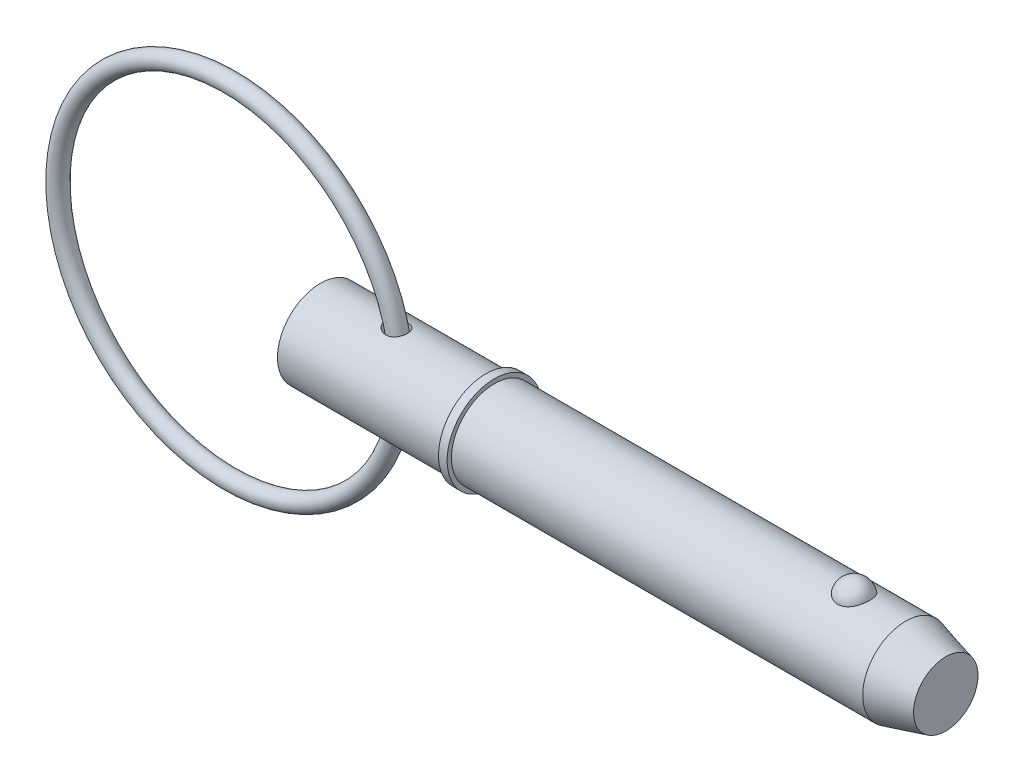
ISO-10303-21;
HEADER;
FILE_DESCRIPTION(('STEP AP214'),'2;1');
FILE_NAME('part.step','',(''),(''),'','','');
FILE_SCHEMA(('AUTOMOTIVE_DESIGN { 1 0 10303 214 1 1 1 1 }'));
ENDSEC;
DATA;
#1=APPLICATION_CONTEXT('core data for automotive mechanical design processes');
#2=APPLICATION_PROTOCOL_DEFINITION('international standard','automotive_design',2000,#1);
#3=PRODUCT_CONTEXT('',#1,'mechanical');
#4=PRODUCT('Part','Part','',(#3));
#5=PRODUCT_RELATED_PRODUCT_CATEGORY('part','',(#4));
#6=PRODUCT_DEFINITION_FORMATION('','',#4);
#7=PRODUCT_DEFINITION_CONTEXT('part definition',#1,'design');
#8=PRODUCT_DEFINITION('design','',#6,#7);
#9=PRODUCT_DEFINITION_SHAPE('','',#8);
#10=(LENGTH_UNIT() NAMED_UNIT(*) SI_UNIT(.MILLI.,.METRE.));
#11=(NAMED_UNIT(*) PLANE_ANGLE_UNIT() SI_UNIT($,.RADIAN.));
#12=(NAMED_UNIT(*) SI_UNIT($,.STERADIAN.) SOLID_ANGLE_UNIT());
#13=UNCERTAINTY_MEASURE_WITH_UNIT(LENGTH_MEASURE(1.E-05),#10,'distance_accuracy_value','');
#14=(GEOMETRIC_REPRESENTATION_CONTEXT(3) GLOBAL_UNCERTAINTY_ASSIGNED_CONTEXT((#13)) GLOBAL_UNIT_ASSIGNED_CONTEXT((#10,
#11,#12)) REPRESENTATION_CONTEXT('',''));
#15=CARTESIAN_POINT('',(0.,0.,0.));
#16=DIRECTION('',(0.,0.,1.));
#17=DIRECTION('',(1.,0.,0.));
#18=AXIS2_PLACEMENT_3D('',#15,#16,#17);
#19=CARTESIAN_POINT('',(-13.3798047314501,0.,0.));
#20=DIRECTION('',(0.,0.,1.));
#21=DIRECTION('',(1.,0.,0.));
#22=AXIS2_PLACEMENT_3D('',#19,#20,#21);
#23=TOROIDAL_SURFACE('',#22,25.4,1.27);
#24=CARTESIAN_POINT('',(13.2901952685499,0.,0.));
#25=VERTEX_POINT('',#24);
#26=VERTEX_LOOP('',#25);
#27=FACE_BOUND('',#26,.T.);
#28=ADVANCED_FACE('P0_F12',(#27),#23,.T.);
#29=CLOSED_SHELL('',(#28));
#30=MANIFOLD_SOLID_BREP('P0_B1',#29);
#31=CARTESIAN_POINT('',(0.,0.,0.));
#32=DIRECTION('',(1.,0.,0.));
#33=DIRECTION('',(0.,0.,-1.));
#34=AXIS2_PLACEMENT_3D('',#31,#32,#33);
#35=CYLINDRICAL_SURFACE('',#34,6.35);
#36=CARTESIAN_POINT('',(9.67500140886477,6.32698634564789,-0.540133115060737));
#37=CARTESIAN_POINT('',(9.70878953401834,6.3197498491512,-0.624879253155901));
#38=CARTESIAN_POINT('',(9.75028044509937,6.31105328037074,-0.706504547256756));
#39=CARTESIAN_POINT('',(9.84659255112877,6.29180070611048,-0.861319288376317));
#40=CARTESIAN_POINT('',(9.90144039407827,6.28124099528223,-0.934491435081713));
#41=CARTESIAN_POINT('',(10.021999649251,6.25949497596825,-1.0704877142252));
#42=CARTESIAN_POINT('',(10.0876589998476,6.2483118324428,-1.13335868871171));
#43=CARTESIAN_POINT('',(10.2280180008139,6.22641783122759,-1.24805262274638));
#44=CARTESIAN_POINT('',(10.3027159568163,6.21570688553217,-1.29987764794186));
#45=CARTESIAN_POINT('',(10.4650889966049,6.19509606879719,-1.39492899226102));
#46=CARTESIAN_POINT('',(10.5533142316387,6.1853135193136,-1.4372443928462));
#47=CARTESIAN_POINT('',(10.7357818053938,6.16871128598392,-1.50691441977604));
#48=CARTESIAN_POINT('',(10.8300253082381,6.16189217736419,-1.53426614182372));
#49=CARTESIAN_POINT('',(11.0227953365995,6.15211299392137,-1.57302798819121));
#50=CARTESIAN_POINT('',(11.1213511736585,6.14918579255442,-1.58430237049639));
#51=CARTESIAN_POINT('',(11.3189518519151,6.1478413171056,-1.58951619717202));
#52=CARTESIAN_POINT('',(11.417996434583,6.14942187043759,-1.58346399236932));
#53=CARTESIAN_POINT('',(11.6070859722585,6.15678569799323,-1.55457003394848));
#54=CARTESIAN_POINT('',(11.6973059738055,6.16229943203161,-1.53280404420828));
#55=CARTESIAN_POINT('',(11.8723373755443,6.17663058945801,-1.4739892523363));
#56=CARTESIAN_POINT('',(11.9571502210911,6.185447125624,-1.43694455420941));
#57=CARTESIAN_POINT('',(12.1146737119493,6.20482821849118,-1.35072170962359));
#58=CARTESIAN_POINT('',(12.1877743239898,6.21528554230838,-1.30222952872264));
#59=CARTESIAN_POINT('',(12.3246187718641,6.23705116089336,-1.19362916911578));
#60=CARTESIAN_POINT('',(12.3883628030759,6.24835943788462,-1.1335212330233));
#61=CARTESIAN_POINT('',(12.5046662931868,6.27053957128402,-1.00357204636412));
#62=CARTESIAN_POINT('',(12.5572571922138,6.28141258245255,-0.933759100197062));
#63=CARTESIAN_POINT('',(12.6502125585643,6.30157953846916,-0.786214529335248));
#64=CARTESIAN_POINT('',(12.6905764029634,6.31087340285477,-0.708482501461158));
#65=CARTESIAN_POINT('',(12.7585531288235,6.32699259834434,-0.546246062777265));
#66=CARTESIAN_POINT('',(12.7860022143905,6.33378599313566,-0.46166981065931));
#67=CARTESIAN_POINT('',(12.8267605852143,6.34401050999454,-0.288980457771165));
#68=CARTESIAN_POINT('',(12.8400695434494,6.34744155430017,-0.200867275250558));
#69=CARTESIAN_POINT('',(12.8522644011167,6.35058177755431,-0.023194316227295));
#70=CARTESIAN_POINT('',(12.8510870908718,6.35027464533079,0.0663700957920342));
#71=CARTESIAN_POINT('',(12.8341831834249,6.34593169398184,0.244024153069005));
#72=CARTESIAN_POINT('',(12.8184563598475,6.341895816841,0.332113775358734));
#73=CARTESIAN_POINT('',(12.7728208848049,6.33052992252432,0.504322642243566));
#74=CARTESIAN_POINT('',(12.7429114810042,6.32319973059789,0.58844167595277));
#75=CARTESIAN_POINT('',(12.6696162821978,6.30604116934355,0.750316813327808));
#76=CARTESIAN_POINT('',(12.6262302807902,6.29621276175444,0.828072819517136));
#77=CARTESIAN_POINT('',(12.5270856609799,6.27515240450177,0.974918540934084));
#78=CARTESIAN_POINT('',(12.4713403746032,6.26392197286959,1.04401746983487));
#79=CARTESIAN_POINT('',(12.3488662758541,6.24131002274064,1.1716478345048));
#80=CARTESIAN_POINT('',(12.2821384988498,6.22992851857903,1.23018026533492));
#81=CARTESIAN_POINT('',(12.1401870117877,6.20841765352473,1.33449214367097));
#82=CARTESIAN_POINT('',(12.0650507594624,6.19827734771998,1.38038832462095));
#83=CARTESIAN_POINT('',(11.9079044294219,6.18026478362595,1.45892404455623));
#84=CARTESIAN_POINT('',(11.8258951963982,6.17239224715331,1.49156520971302));
#85=CARTESIAN_POINT('',(11.6581736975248,6.15982613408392,1.54263810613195));
#86=CARTESIAN_POINT('',(11.572502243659,6.15510409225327,1.56119728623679));
#87=CARTESIAN_POINT('',(11.3991899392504,6.14916283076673,1.58443707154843));
#88=CARTESIAN_POINT('',(11.3115488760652,6.14794399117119,1.58911617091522));
#89=CARTESIAN_POINT('',(11.1345547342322,6.14904466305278,1.58485137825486));
#90=CARTESIAN_POINT('',(11.0452104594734,6.15144894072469,1.5755811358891));
#91=CARTESIAN_POINT('',(10.8691479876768,6.15957601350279,1.54349959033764));
#92=CARTESIAN_POINT('',(10.782430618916,6.16529984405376,1.52068406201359));
#93=CARTESIAN_POINT('',(10.6082848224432,6.17983892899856,1.4605156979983));
#94=CARTESIAN_POINT('',(10.5211557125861,6.1888262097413,1.42233764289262));
#95=CARTESIAN_POINT('',(10.3542377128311,6.20874782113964,1.33268652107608));
#96=CARTESIAN_POINT('',(10.2744521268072,6.21968302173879,1.28120750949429));
#97=CARTESIAN_POINT('',(10.120854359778,6.24282707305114,1.16334748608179));
#98=CARTESIAN_POINT('',(10.0474902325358,6.25507146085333,1.09638652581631));
#99=CARTESIAN_POINT('',(9.9136869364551,6.27890019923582,0.950453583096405));
#100=CARTESIAN_POINT('',(9.85324511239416,6.29048468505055,0.871484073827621));
#101=CARTESIAN_POINT('',(9.75037543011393,6.31102161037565,0.707140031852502));
#102=CARTESIAN_POINT('',(9.70726585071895,6.32006820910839,0.622206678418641));
#103=CARTESIAN_POINT('',(9.63775895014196,6.33497125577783,0.445490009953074));
#104=CARTESIAN_POINT('',(9.61134627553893,6.34083063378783,0.35371307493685));
#105=CARTESIAN_POINT('',(9.57891955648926,6.34807071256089,0.177220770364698));
#106=CARTESIAN_POINT('',(9.57093524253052,6.3498832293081,0.0928817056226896));
#107=CARTESIAN_POINT('',(9.56994851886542,6.35010532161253,-0.0758268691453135));
#108=CARTESIAN_POINT('',(9.57692695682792,6.34851924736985,-0.160196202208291));
#109=CARTESIAN_POINT('',(9.59985709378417,6.34339435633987,-0.294043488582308));
#110=CARTESIAN_POINT('',(9.61128951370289,6.34084912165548,-0.344385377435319));
#111=CARTESIAN_POINT('',(9.63933183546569,6.33468615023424,-0.443526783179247));
#112=CARTESIAN_POINT('',(9.65594100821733,6.33106856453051,-0.492326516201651));
#113=CARTESIAN_POINT('',(9.67500140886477,6.32698634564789,-0.540133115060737));
#114=B_SPLINE_CURVE_WITH_KNOTS('',3,(#36,#37,#38,#39,#40,#41,#42,#43,#44,#45,#46,#47,#48,#49,
#50,#51,#52,#53,#54,#55,#56,#57,#58,#59,#60,#61,#62,#63,#64,#65,#66,#67,#68,#69,#70,#71,#72,#73,
#74,#75,#76,#77,#78,#79,#80,#81,#82,#83,#84,#85,#86,#87,#88,#89,#90,#91,#92,#93,#94,#95,#96,#97,
#98,#99,#100,#101,#102,#103,#104,#105,#106,#107,#108,#109,#110,#111,#112,#113),.UNSPECIFIED.,
.T.,.F.,(4,2,2,2,2,2,2,2,2,2,2,2,2,2,2,2,2,2,2,2,2,2,2,2,2,2,2,2,2,2,2,2,2,2,2,2,2,2,4),(0.,
0.274348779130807,0.549249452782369,0.822863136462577,1.09642560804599,1.39007706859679,
1.68378550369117,1.97995934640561,2.27599046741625,2.55347281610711,2.83088067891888,
3.09465189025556,3.35841759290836,3.62142956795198,3.88445494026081,4.1507318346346,
4.4170148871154,4.68446025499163,4.95190978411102,5.21937350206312,5.48684131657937,
5.75402200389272,6.02117751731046,6.28577524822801,6.55034050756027,6.81248178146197,
7.0746514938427,7.34305086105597,7.61153399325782,7.89692981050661,8.18245340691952,
8.48120635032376,8.77989784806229,9.06530254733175,9.35044442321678,9.60331609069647,
9.85586427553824,10.010650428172,10.1654147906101),.UNSPECIFIED.);
#115=CARTESIAN_POINT('',(9.67500140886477,6.32698634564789,-0.540133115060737));
#116=VERTEX_POINT('',#115);
#117=EDGE_CURVE('P1_E42',#116,#116,#114,.T.);
#118=ORIENTED_EDGE('',*,*,#117,.T.);
#119=EDGE_LOOP('',(#118));
#120=FACE_BOUND('',#119,.T.);
#121=CARTESIAN_POINT('',(0.,0.,0.));
#122=DIRECTION('',(1.,0.,0.));
#123=DIRECTION('',(0.,0.,-1.));
#124=AXIS2_PLACEMENT_3D('',#121,#122,#123);
#125=CIRCLE('',#124,6.35);
#126=CARTESIAN_POINT('',(0.,0.,-6.35));
#127=VERTEX_POINT('',#126);
#128=EDGE_CURVE('P1_E9',#127,#127,#125,.T.);
#129=ORIENTED_EDGE('',*,*,#128,.T.);
#130=EDGE_LOOP('',(#129));
#131=FACE_BOUND('',#130,.T.);
#132=CARTESIAN_POINT('',(24.43,0.,0.));
#133=DIRECTION('',(1.,0.,0.));
#134=DIRECTION('',(0.,0.,-1.));
#135=AXIS2_PLACEMENT_3D('',#132,#133,#134);
#136=CIRCLE('',#135,6.35);
#137=CARTESIAN_POINT('',(24.43,0.,-6.35));
#138=VERTEX_POINT('',#137);
#139=EDGE_CURVE('P1_E25',#138,#138,#136,.T.);
#140=ORIENTED_EDGE('',*,*,#139,.F.);
#141=EDGE_LOOP('',(#140));
#142=FACE_BOUND('',#141,.T.);
#143=CARTESIAN_POINT('',(9.67500140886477,-6.32698634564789,-0.540133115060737));
#144=CARTESIAN_POINT('',(9.64544894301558,-6.33331515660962,-0.466002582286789));
#145=CARTESIAN_POINT('',(9.62177180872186,-6.33852974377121,-0.389437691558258));
#146=CARTESIAN_POINT('',(9.58727043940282,-6.34619174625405,-0.233330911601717));
#147=CARTESIAN_POINT('',(9.57644043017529,-6.34864040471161,-0.153790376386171));
#148=CARTESIAN_POINT('',(9.56819517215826,-6.3505010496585,0.00612071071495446));
#149=CARTESIAN_POINT('',(9.57079639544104,-6.34990930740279,0.0864921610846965));
#150=CARTESIAN_POINT('',(9.58930797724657,-6.3457478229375,0.245607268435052));
#151=CARTESIAN_POINT('',(9.60522046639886,-6.34217760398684,0.324350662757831));
#152=CARTESIAN_POINT('',(9.64931570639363,-6.3324977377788,0.47727605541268));
#153=CARTESIAN_POINT('',(9.67737525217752,-6.32641361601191,0.551495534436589));
#154=CARTESIAN_POINT('',(9.74451510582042,-6.31231128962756,0.694551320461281));
#155=CARTESIAN_POINT('',(9.78359827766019,-6.30429258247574,0.763386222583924));
#156=CARTESIAN_POINT('',(9.87474700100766,-6.28638332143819,0.899414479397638));
#157=CARTESIAN_POINT('',(9.92757481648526,-6.27639669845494,0.966083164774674));
#158=CARTESIAN_POINT('',(10.042675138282,-6.25596164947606,1.09061181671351));
#159=CARTESIAN_POINT('',(10.1049521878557,-6.24551300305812,1.14846751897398));
#160=CARTESIAN_POINT('',(10.2445505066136,-6.22397505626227,1.26024641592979));
#161=CARTESIAN_POINT('',(10.3227711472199,-6.2129394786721,1.31305951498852));
#162=CARTESIAN_POINT('',(10.4867924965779,-6.19263757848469,1.40570084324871));
#163=CARTESIAN_POINT('',(10.5725962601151,-6.18337197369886,1.44552380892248));
#164=CARTESIAN_POINT('',(10.7543302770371,-6.16725983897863,1.51283687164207));
#165=CARTESIAN_POINT('',(10.8505554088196,-6.16056505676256,1.53957358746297));
#166=CARTESIAN_POINT('',(11.0463546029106,-6.15127671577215,1.57628137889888));
#167=CARTESIAN_POINT('',(11.1459276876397,-6.14868197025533,1.58625730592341));
#168=CARTESIAN_POINT('',(11.3414257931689,-6.14810798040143,1.58848000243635));
#169=CARTESIAN_POINT('',(11.4373417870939,-6.14995283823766,1.58140242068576));
#170=CARTESIAN_POINT('',(11.6262783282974,-6.1577972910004,1.55057566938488));
#171=CARTESIAN_POINT('',(11.719300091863,-6.16379511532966,1.52683360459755));
#172=CARTESIAN_POINT('',(11.8934223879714,-6.17873566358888,1.46514575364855));
#173=CARTESIAN_POINT('',(11.9749048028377,-6.18746207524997,1.42822144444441));
#174=CARTESIAN_POINT('',(12.1301362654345,-6.20693584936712,1.3410564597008));
#175=CARTESIAN_POINT('',(12.2038861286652,-6.21768299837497,1.29081719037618));
#176=CARTESIAN_POINT('',(12.3399792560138,-6.23970077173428,1.17972764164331));
#177=CARTESIAN_POINT('',(12.4025430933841,-6.25095401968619,1.11914355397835));
#178=CARTESIAN_POINT('',(12.5166805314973,-6.27296916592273,0.988307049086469));
#179=CARTESIAN_POINT('',(12.568253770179,-6.28373104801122,0.918054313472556));
#180=CARTESIAN_POINT('',(12.6596230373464,-6.3037060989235,0.769081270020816));
#181=CARTESIAN_POINT('',(12.6992956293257,-6.31290263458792,0.690283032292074));
#182=CARTESIAN_POINT('',(12.7652258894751,-6.32862394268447,0.527011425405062));
#183=CARTESIAN_POINT('',(12.7914829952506,-6.33514860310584,0.442537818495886));
#184=CARTESIAN_POINT('',(12.8301436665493,-6.34487485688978,0.269505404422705));
#185=CARTESIAN_POINT('',(12.8424230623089,-6.34804664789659,0.180917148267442));
#186=CARTESIAN_POINT('',(12.8524214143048,-6.35062347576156,0.00286829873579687));
#187=CARTESIAN_POINT('',(12.8501402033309,-6.35002846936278,-0.0865923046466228));
#188=CARTESIAN_POINT('',(12.8310619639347,-6.34513332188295,-0.263931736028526));
#189=CARTESIAN_POINT('',(12.8142517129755,-6.34082980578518,-0.35180904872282));
#190=CARTESIAN_POINT('',(12.7664911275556,-6.32897674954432,-0.523406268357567));
#191=CARTESIAN_POINT('',(12.7355404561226,-6.3214271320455,-0.607126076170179));
#192=CARTESIAN_POINT('',(12.6602298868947,-6.30390232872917,-0.768030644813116));
#193=CARTESIAN_POINT('',(12.6158695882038,-6.29392707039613,-0.84521521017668));
#194=CARTESIAN_POINT('',(12.5148171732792,-6.2726521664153,-0.990836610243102));
#195=CARTESIAN_POINT('',(12.4581254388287,-6.26135256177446,-1.05927371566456));
#196=CARTESIAN_POINT('',(12.33416419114,-6.2387572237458,-1.18510935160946));
#197=CARTESIAN_POINT('',(12.2669484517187,-6.22746174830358,-1.24256086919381));
#198=CARTESIAN_POINT('',(12.1235592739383,-6.20610255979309,-1.34519464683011));
#199=CARTESIAN_POINT('',(12.0473871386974,-6.19603866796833,-1.39037868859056));
#200=CARTESIAN_POINT('',(11.8892714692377,-6.17839642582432,-1.46678006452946));
#201=CARTESIAN_POINT('',(11.8074126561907,-6.17078838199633,-1.49816605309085));
#202=CARTESIAN_POINT('',(11.6394563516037,-6.15869606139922,-1.54712759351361));
#203=CARTESIAN_POINT('',(11.5533589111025,-6.15421174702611,-1.56470331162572));
#204=CARTESIAN_POINT('',(11.3789660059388,-6.14876652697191,-1.58596734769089));
#205=CARTESIAN_POINT('',(11.2906621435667,-6.1478222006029,-1.58959032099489));
#206=CARTESIAN_POINT('',(11.1146029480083,-6.149490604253,-1.58312110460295));
#207=CARTESIAN_POINT('',(11.0268477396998,-6.1521041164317,-1.57302589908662));
#208=CARTESIAN_POINT('',(10.8498668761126,-6.16071031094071,-1.53898332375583));
#209=CARTESIAN_POINT('',(10.7607726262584,-6.16685908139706,-1.51439468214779));
#210=CARTESIAN_POINT('',(10.5876521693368,-6.18189031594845,-1.45181305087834));
#211=CARTESIAN_POINT('',(10.5036282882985,-6.19077402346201,-1.41381396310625));
#212=CARTESIAN_POINT('',(10.3374228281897,-6.2109378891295,-1.32252480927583));
#213=CARTESIAN_POINT('',(10.255708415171,-6.2223355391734,-1.26840756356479));
#214=CARTESIAN_POINT('',(10.1025645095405,-6.24580740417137,-1.14725208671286));
#215=CARTESIAN_POINT('',(10.0311354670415,-6.25788164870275,-1.08021329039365));
#216=CARTESIAN_POINT('',(9.90472699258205,-6.2806176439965,-0.938710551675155));
#217=CARTESIAN_POINT('',(9.84904456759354,-6.29132066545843,-0.864883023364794));
#218=CARTESIAN_POINT('',(9.75129345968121,-6.31084098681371,-0.708496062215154));
#219=CARTESIAN_POINT('',(9.70921094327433,-6.31966019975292,-0.625945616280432));
#220=CARTESIAN_POINT('',(9.67500140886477,-6.32698634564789,-0.540133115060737));
#221=B_SPLINE_CURVE_WITH_KNOTS('',3,(#143,#144,#145,#146,#147,#148,#149,#150,#151,#152,#153,
#154,#155,#156,#157,#158,#159,#160,#161,#162,#163,#164,#165,#166,#167,#168,#169,#170,#171,#172,
#173,#174,#175,#176,#177,#178,#179,#180,#181,#182,#183,#184,#185,#186,#187,#188,#189,#190,#191,
#192,#193,#194,#195,#196,#197,#198,#199,#200,#201,#202,#203,#204,#205,#206,#207,#208,#209,#210,
#211,#212,#213,#214,#215,#216,#217,#218,#219,#220),.UNSPECIFIED.,.T.,.F.,(4,2,2,2,2,2,2,2,2,2,2,
2,2,2,2,2,2,2,2,2,2,2,2,2,2,2,2,2,2,2,2,2,2,2,2,2,2,2,4),(0.,0.239871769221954,
0.479635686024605,0.719693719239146,0.959790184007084,1.19750645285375,1.43528453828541,
1.69117930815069,1.94719750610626,2.23102979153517,2.51497694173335,2.81376497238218,
3.11246650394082,3.39952951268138,3.68647020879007,3.95479420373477,4.22308987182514,
4.48530700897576,4.74753278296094,5.01239119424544,5.27726070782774,5.54446524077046,
5.81167284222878,6.07912387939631,6.34658129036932,6.61404669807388,6.88150382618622,
7.14763644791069,7.41373039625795,7.67647472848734,7.93921589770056,8.20318607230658,
8.46721428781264,8.74390821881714,9.02072813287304,9.31537622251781,9.61003720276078,
9.88799314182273,10.1656654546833),.UNSPECIFIED.);
#222=CARTESIAN_POINT('',(9.67500140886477,-6.32698634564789,-0.540133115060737));
#223=VERTEX_POINT('',#222);
#224=EDGE_CURVE('P1_E17',#223,#223,#221,.T.);
#225=ORIENTED_EDGE('',*,*,#224,.T.);
#226=EDGE_LOOP('',(#225));
#227=FACE_BOUND('',#226,.T.);
#228=ADVANCED_FACE('P1_F13',(#120,#131,#142,#227),#35,.T.);
#229=CARTESIAN_POINT('',(0.,0.,0.));
#230=DIRECTION('',(1.,0.,0.));
#231=DIRECTION('',(0.,0.,-1.));
#232=AXIS2_PLACEMENT_3D('',#229,#230,#231);
#233=CYLINDRICAL_SURFACE('',#232,6.35);
#234=CARTESIAN_POINT('',(86.4553693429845,0.,0.));
#235=DIRECTION('',(1.,0.,0.));
#236=DIRECTION('',(0.,0.,-1.));
#237=AXIS2_PLACEMENT_3D('',#234,#235,#236);
#238=CIRCLE('',#237,6.35);
#239=CARTESIAN_POINT('',(86.4553693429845,0.,-6.35));
#240=VERTEX_POINT('',#239);
#241=EDGE_CURVE('P1_E99',#240,#240,#238,.T.);
#242=ORIENTED_EDGE('',*,*,#241,.F.);
#243=EDGE_LOOP('',(#242));
#244=FACE_BOUND('',#243,.T.);
#245=CARTESIAN_POINT('',(25.7,0.,0.));
#246=DIRECTION('',(1.,0.,0.));
#247=DIRECTION('',(0.,0.,-1.));
#248=AXIS2_PLACEMENT_3D('',#245,#246,#247);
#249=CIRCLE('',#248,6.35);
#250=CARTESIAN_POINT('',(25.7,0.,-6.35));
#251=VERTEX_POINT('',#250);
#252=EDGE_CURVE('P1_E96',#251,#251,#249,.T.);
#253=ORIENTED_EDGE('',*,*,#252,.T.);
#254=EDGE_LOOP('',(#253));
#255=FACE_BOUND('',#254,.T.);
#256=CARTESIAN_POINT('',(78.8300214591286,5.87502187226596,2.40969251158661));
#257=CARTESIAN_POINT('',(78.705030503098,5.87501645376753,2.40969773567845));
#258=CARTESIAN_POINT('',(78.5800806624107,5.87916061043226,2.39967292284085));
#259=CARTESIAN_POINT('',(78.3339091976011,5.8952311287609,2.35991730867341));
#260=CARTESIAN_POINT('',(78.2126863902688,5.90715499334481,2.33019283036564));
#261=CARTESIAN_POINT('',(77.9775170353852,5.93739567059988,2.252014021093));
#262=CARTESIAN_POINT('',(77.8635602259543,5.95570321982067,2.20358681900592));
#263=CARTESIAN_POINT('',(77.6455735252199,5.99672067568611,2.089379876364));
#264=CARTESIAN_POINT('',(77.5415457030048,6.01943149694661,2.02359652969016));
#265=CARTESIAN_POINT('',(77.3429437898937,6.06760647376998,1.87428969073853));
#266=CARTESIAN_POINT('',(77.2487268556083,6.09313095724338,1.79031110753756));
#267=CARTESIAN_POINT('',(77.0752557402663,6.14375873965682,1.60800178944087));
#268=CARTESIAN_POINT('',(76.9960043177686,6.16886196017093,1.50966841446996));
#269=CARTESIAN_POINT('',(76.8508457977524,6.21724600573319,1.29645884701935));
#270=CARTESIAN_POINT('',(76.7856885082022,6.24039621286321,1.18104158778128));
#271=CARTESIAN_POINT('',(76.6747035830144,6.28117277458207,0.940351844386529));
#272=CARTESIAN_POINT('',(76.6288776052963,6.29879865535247,0.81507851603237));
#273=CARTESIAN_POINT('',(76.5570234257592,6.32692073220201,0.556494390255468));
#274=CARTESIAN_POINT('',(76.531249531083,6.33732517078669,0.423102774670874));
#275=CARTESIAN_POINT('',(76.5009885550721,6.34957673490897,0.153542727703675));
#276=CARTESIAN_POINT('',(76.4965009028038,6.35142408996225,0.0173743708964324));
#277=CARTESIAN_POINT('',(76.5088655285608,6.34638925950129,-0.253036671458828));
#278=CARTESIAN_POINT('',(76.5255949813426,6.33955731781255,-0.387285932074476));
#279=CARTESIAN_POINT('',(76.579843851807,6.31794129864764,-0.650851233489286));
#280=CARTESIAN_POINT('',(76.6173636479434,6.30315707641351,-0.780167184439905));
#281=CARTESIAN_POINT('',(76.712500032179,6.26711642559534,-1.03041949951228));
#282=CARTESIAN_POINT('',(76.7701436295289,6.24585130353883,-1.15134433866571));
#283=CARTESIAN_POINT('',(76.9043522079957,6.19905619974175,-1.38129800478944));
#284=CARTESIAN_POINT('',(76.980918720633,6.17352587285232,-1.49032586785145));
#285=CARTESIAN_POINT('',(77.1517538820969,6.12080227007,-1.69393164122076));
#286=CARTESIAN_POINT('',(77.2461008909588,6.09360200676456,-1.78844209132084));
#287=CARTESIAN_POINT('',(77.4501196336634,6.04070434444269,-1.95970536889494));
#288=CARTESIAN_POINT('',(77.559790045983,6.01500681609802,-2.03645972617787));
#289=CARTESIAN_POINT('',(77.7891876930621,5.96867714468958,-2.16845644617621));
#290=CARTESIAN_POINT('',(77.9086522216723,5.94794910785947,-2.22412062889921));
#291=CARTESIAN_POINT('',(78.1562188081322,5.91340580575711,-2.31440992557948));
#292=CARTESIAN_POINT('',(78.2843175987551,5.89958794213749,-2.34904294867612));
#293=CARTESIAN_POINT('',(78.5385820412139,5.88111049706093,-2.39491590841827));
#294=CARTESIAN_POINT('',(78.6645207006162,5.87602512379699,-2.40724512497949));
#295=CARTESIAN_POINT('',(78.9167867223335,5.87428980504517,-2.4114786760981));
#296=CARTESIAN_POINT('',(79.043114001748,5.87763817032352,-2.40338710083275));
#297=CARTESIAN_POINT('',(79.2884170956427,5.89212921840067,-2.36762715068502));
#298=CARTESIAN_POINT('',(79.4074992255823,5.90302431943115,-2.34058030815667));
#299=CARTESIAN_POINT('',(79.6392447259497,5.93113752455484,-2.26839066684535));
#300=CARTESIAN_POINT('',(79.7519075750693,5.94835614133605,-2.22324640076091));
#301=CARTESIAN_POINT('',(79.9704009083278,5.98773016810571,-2.11493806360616));
#302=CARTESIAN_POINT('',(80.076028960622,6.00998499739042,-2.05140269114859));
#303=CARTESIAN_POINT('',(80.2753006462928,6.05690144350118,-1.90842705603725));
#304=CARTESIAN_POINT('',(80.3689415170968,6.08156361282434,-1.82898313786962));
#305=CARTESIAN_POINT('',(80.5466754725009,6.13211715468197,-1.65182429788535));
#306=CARTESIAN_POINT('',(80.630055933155,6.15800825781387,-1.55339381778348));
#307=CARTESIAN_POINT('',(80.7797900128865,6.20712834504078,-1.34374214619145));
#308=CARTESIAN_POINT('',(80.8461405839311,6.23035685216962,-1.23251867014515));
#309=CARTESIAN_POINT('',(80.9623455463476,6.27251177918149,-0.996447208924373));
#310=CARTESIAN_POINT('',(81.0116072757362,6.29127762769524,-0.871278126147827));
#311=CARTESIAN_POINT('',(81.0896142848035,6.3215862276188,-0.613870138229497));
#312=CARTESIAN_POINT('',(81.1183593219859,6.33312889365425,-0.48163114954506));
#313=CARTESIAN_POINT('',(81.1547705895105,6.34782349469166,-0.213672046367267));
#314=CARTESIAN_POINT('',(81.1624134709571,6.35096613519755,-0.0779482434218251));
#315=CARTESIAN_POINT('',(81.1563951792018,6.34851322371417,0.192943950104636));
#316=CARTESIAN_POINT('',(81.1427343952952,6.3429178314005,0.328112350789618));
#317=CARTESIAN_POINT('',(81.0945036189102,6.32360512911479,0.593406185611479));
#318=CARTESIAN_POINT('',(81.0600313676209,6.30992579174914,0.723552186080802));
#319=CARTESIAN_POINT('',(80.9709539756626,6.27586325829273,0.975834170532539));
#320=CARTESIAN_POINT('',(80.9163476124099,6.25547965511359,1.09796966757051));
#321=CARTESIAN_POINT('',(80.7877587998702,6.20998183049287,1.33148921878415));
#322=CARTESIAN_POINT('',(80.7136742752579,6.18484288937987,1.44281227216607));
#323=CARTESIAN_POINT('',(80.5478204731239,6.13258735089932,1.65087683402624));
#324=CARTESIAN_POINT('',(80.4560515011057,6.10547078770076,1.74761859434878));
#325=CARTESIAN_POINT('',(80.2571839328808,6.0523587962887,1.92350926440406));
#326=CARTESIAN_POINT('',(80.150133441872,6.0263601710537,2.00271146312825));
#327=CARTESIAN_POINT('',(79.9231384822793,5.97843747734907,2.14154159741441));
#328=CARTESIAN_POINT('',(79.803191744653,5.95651412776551,2.20116608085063));
#329=CARTESIAN_POINT('',(79.5445236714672,5.91812106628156,2.30250570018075));
#330=CARTESIAN_POINT('',(79.4050698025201,5.90217533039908,2.34256795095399));
#331=CARTESIAN_POINT('',(79.1203974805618,5.88063128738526,2.39615214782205));
#332=CARTESIAN_POINT('',(78.9751817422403,5.87502816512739,2.40968644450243));
#333=CARTESIAN_POINT('',(78.8300214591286,5.87502187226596,2.40969251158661));
#334=B_SPLINE_CURVE_WITH_KNOTS('',3,(#256,#257,#258,#259,#260,#261,#262,#263,#264,#265,#266,
#267,#268,#269,#270,#271,#272,#273,#274,#275,#276,#277,#278,#279,#280,#281,#282,#283,#284,#285,
#286,#287,#288,#289,#290,#291,#292,#293,#294,#295,#296,#297,#298,#299,#300,#301,#302,#303,#304,
#305,#306,#307,#308,#309,#310,#311,#312,#313,#314,#315,#316,#317,#318,#319,#320,#321,#322,#323,
#324,#325,#326,#327,#328,#329,#330,#331,#332,#333),.UNSPECIFIED.,.T.,.F.,(4,2,2,2,2,2,2,2,2,2,2,
2,2,2,2,2,2,2,2,2,2,2,2,2,2,2,2,2,2,2,2,2,2,2,2,2,2,2,4),(0.,0.374440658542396,
0.748761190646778,1.12254078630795,1.49639810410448,1.88098871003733,2.26565013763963,
2.66741104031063,3.06920639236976,3.47601794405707,3.88281858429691,4.28727498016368,
4.69173873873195,5.09674745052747,5.50178895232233,5.90865911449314,6.31549420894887,
6.7136985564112,7.11175305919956,7.48978077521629,7.86773278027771,8.23383886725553,
8.59997464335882,8.974090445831,9.34829231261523,9.74122667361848,10.1342313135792,
10.5397522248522,10.9452779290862,11.3512521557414,11.7572189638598,12.1612938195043,
12.5653932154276,12.9716540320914,13.3779078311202,13.7829098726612,14.1879832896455,
14.6230486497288,15.057911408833),.UNSPECIFIED.);
#335=CARTESIAN_POINT('',(78.8300214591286,5.87502187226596,2.40969251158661));
#336=VERTEX_POINT('',#335);
#337=EDGE_CURVE('P1_E34',#336,#336,#334,.T.);
#338=ORIENTED_EDGE('',*,*,#337,.T.);
#339=EDGE_LOOP('',(#338));
#340=FACE_BOUND('',#339,.T.);
#341=ADVANCED_FACE('P1_F46',(#244,#255,#340),#233,.T.);
#342=CARTESIAN_POINT('',(0.,0.,0.));
#343=DIRECTION('',(-1.,0.,0.));
#344=DIRECTION('',(0.,0.,1.));
#345=AXIS2_PLACEMENT_3D('',#342,#343,#344);
#346=PLANE('',#345);
#347=ORIENTED_EDGE('',*,*,#128,.F.);
#348=EDGE_LOOP('',(#347));
#349=FACE_BOUND('',#348,.T.);
#350=ADVANCED_FACE('P1_F15',(#349),#346,.T.);
#351=CARTESIAN_POINT('',(24.43,6.35,0.));
#352=DIRECTION('',(-1.,0.,0.));
#353=DIRECTION('',(0.,0.,1.));
#354=AXIS2_PLACEMENT_3D('',#351,#352,#353);
#355=PLANE('',#354);
#356=ORIENTED_EDGE('',*,*,#139,.T.);
#357=EDGE_LOOP('',(#356));
#358=FACE_BOUND('',#357,.T.);
#359=CARTESIAN_POINT('',(24.43,0.,0.));
#360=DIRECTION('',(1.,0.,0.));
#361=DIRECTION('',(0.,0.,-1.));
#362=AXIS2_PLACEMENT_3D('',#359,#360,#361);
#363=CIRCLE('',#362,6.985);
#364=CARTESIAN_POINT('',(24.43,0.,-6.985));
#365=VERTEX_POINT('',#364);
#366=EDGE_CURVE('P1_E30',#365,#365,#363,.T.);
#367=ORIENTED_EDGE('',*,*,#366,.F.);
#368=EDGE_LOOP('',(#367));
#369=FACE_BOUND('',#368,.T.);
#370=ADVANCED_FACE('P1_F81',(#358,#369),#355,.T.);
#371=CARTESIAN_POINT('',(0.,0.,0.));
#372=DIRECTION('',(1.,0.,0.));
#373=DIRECTION('',(0.,0.,-1.));
#374=AXIS2_PLACEMENT_3D('',#371,#372,#373);
#375=CYLINDRICAL_SURFACE('',#374,6.985);
#376=ORIENTED_EDGE('',*,*,#366,.T.);
#377=EDGE_LOOP('',(#376));
#378=FACE_BOUND('',#377,.T.);
#379=CARTESIAN_POINT('',(25.7,0.,0.));
#380=DIRECTION('',(1.,0.,0.));
#381=DIRECTION('',(0.,0.,-1.));
#382=AXIS2_PLACEMENT_3D('',#379,#380,#381);
#383=CIRCLE('',#382,6.985);
#384=CARTESIAN_POINT('',(25.7,0.,-6.985));
#385=VERTEX_POINT('',#384);
#386=EDGE_CURVE('P1_E95',#385,#385,#383,.T.);
#387=ORIENTED_EDGE('',*,*,#386,.F.);
#388=EDGE_LOOP('',(#387));
#389=FACE_BOUND('',#388,.T.);
#390=ADVANCED_FACE('P1_F68',(#378,#389),#375,.T.);
#391=CARTESIAN_POINT('',(25.7,6.985,0.));
#392=DIRECTION('',(1.,0.,0.));
#393=DIRECTION('',(0.,0.,-1.));
#394=AXIS2_PLACEMENT_3D('',#391,#392,#393);
#395=PLANE('',#394);
#396=ORIENTED_EDGE('',*,*,#386,.T.);
#397=EDGE_LOOP('',(#396));
#398=FACE_BOUND('',#397,.T.);
#399=ORIENTED_EDGE('',*,*,#252,.F.);
#400=EDGE_LOOP('',(#399));
#401=FACE_BOUND('',#400,.T.);
#402=ADVANCED_FACE('P1_F62',(#398,#401),#395,.T.);
#403=CARTESIAN_POINT('',(92.38,0.,0.));
#404=DIRECTION('',(-1.,0.,0.));
#405=DIRECTION('',(0.,0.,1.));
#406=AXIS2_PLACEMENT_3D('',#403,#404,#405);
#407=CONICAL_SURFACE('',#406,4.76250000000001,0.26179938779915);
#408=ORIENTED_EDGE('',*,*,#241,.T.);
#409=EDGE_LOOP('',(#408));
#410=FACE_BOUND('',#409,.T.);
#411=CARTESIAN_POINT('',(92.38,0.,0.));
#412=DIRECTION('',(1.,0.,0.));
#413=DIRECTION('',(0.,0.,-1.));
#414=AXIS2_PLACEMENT_3D('',#411,#412,#413);
#415=CIRCLE('',#414,4.76250000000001);
#416=CARTESIAN_POINT('',(92.38,0.,-4.76250000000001));
#417=VERTEX_POINT('',#416);
#418=EDGE_CURVE('P1_E41',#417,#417,#415,.T.);
#419=ORIENTED_EDGE('',*,*,#418,.F.);
#420=EDGE_LOOP('',(#419));
#421=FACE_BOUND('',#420,.T.);
#422=ADVANCED_FACE('P1_F59',(#410,#421),#407,.T.);
#423=CARTESIAN_POINT('',(92.38,4.76250000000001,0.));
#424=DIRECTION('',(1.,0.,0.));
#425=DIRECTION('',(0.,0.,-1.));
#426=AXIS2_PLACEMENT_3D('',#423,#424,#425);
#427=PLANE('',#426);
#428=ORIENTED_EDGE('',*,*,#418,.T.);
#429=EDGE_LOOP('',(#428));
#430=FACE_BOUND('',#429,.T.);
#431=ADVANCED_FACE('P1_F55',(#430),#427,.T.);
#432=CARTESIAN_POINT('',(78.8300214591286,5.715,0.));
#433=DIRECTION('',(-1.,0.,0.));
#434=DIRECTION('',(0.,1.,0.));
#435=AXIS2_PLACEMENT_3D('',#432,#433,#434);
#436=SPHERICAL_SURFACE('',#435,2.41500000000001);
#437=ORIENTED_EDGE('',*,*,#337,.F.);
#438=EDGE_LOOP('',(#437));
#439=FACE_BOUND('',#438,.T.);
#440=ADVANCED_FACE('P1_F50',(#439),#436,.T.);
#441=CARTESIAN_POINT('',(-13.3798047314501,0.,0.));
#442=DIRECTION('',(0.,0.,1.));
#443=DIRECTION('',(1.,0.,0.));
#444=AXIS2_PLACEMENT_3D('',#441,#442,#443);
#445=TOROIDAL_SURFACE('',#444,25.4,1.5875);
#446=ORIENTED_EDGE('',*,*,#224,.F.);
#447=EDGE_LOOP('',(#446));
#448=FACE_BOUND('',#447,.T.);
#449=ORIENTED_EDGE('',*,*,#117,.F.);
#450=EDGE_LOOP('',(#449));
#451=FACE_BOUND('',#450,.T.);
#452=ADVANCED_FACE('P1_F54',(#448,#451),#445,.F.);
#453=CLOSED_SHELL('',(#228,#341,#350,#370,#390,#402,#422,#431,#440,#452));
#454=MANIFOLD_SOLID_BREP('P1_B1',#453);
#455=ADVANCED_BREP_SHAPE_REPRESENTATION('',(#18,#30,#454),#14);
#456=SHAPE_DEFINITION_REPRESENTATION(#9,#455);
ENDSEC;
END-ISO-10303-21;
